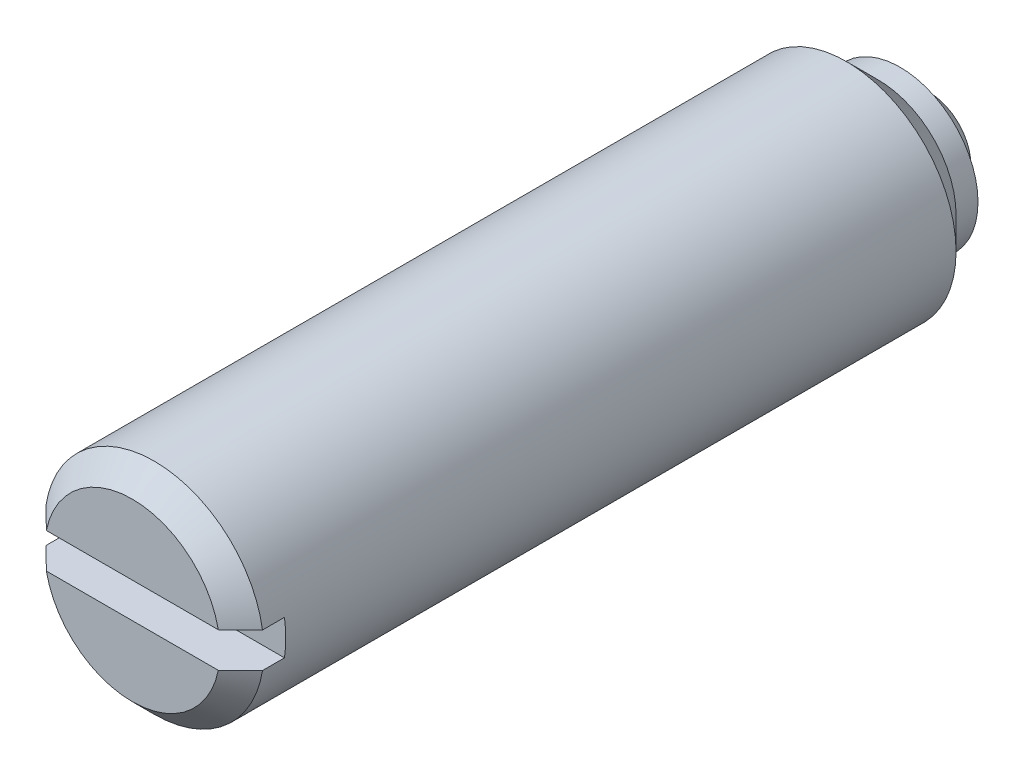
ISO-10303-21;
HEADER;
FILE_DESCRIPTION(('STEP AP214'),'2;1');
FILE_NAME('part.step','',(''),(''),'','','');
FILE_SCHEMA(('AUTOMOTIVE_DESIGN { 1 0 10303 214 1 1 1 1 }'));
ENDSEC;
DATA;
#1=APPLICATION_CONTEXT('core data for automotive mechanical design processes');
#2=APPLICATION_PROTOCOL_DEFINITION('international standard','automotive_design',2000,#1);
#3=PRODUCT_CONTEXT('',#1,'mechanical');
#4=PRODUCT('Part','Part','',(#3));
#5=PRODUCT_RELATED_PRODUCT_CATEGORY('part','',(#4));
#6=PRODUCT_DEFINITION_FORMATION('','',#4);
#7=PRODUCT_DEFINITION_CONTEXT('part definition',#1,'design');
#8=PRODUCT_DEFINITION('design','',#6,#7);
#9=PRODUCT_DEFINITION_SHAPE('','',#8);
#10=(LENGTH_UNIT() NAMED_UNIT(*) SI_UNIT(.MILLI.,.METRE.));
#11=(NAMED_UNIT(*) PLANE_ANGLE_UNIT() SI_UNIT($,.RADIAN.));
#12=(NAMED_UNIT(*) SI_UNIT($,.STERADIAN.) SOLID_ANGLE_UNIT());
#13=UNCERTAINTY_MEASURE_WITH_UNIT(LENGTH_MEASURE(1.E-05),#10,'distance_accuracy_value','');
#14=(GEOMETRIC_REPRESENTATION_CONTEXT(3) GLOBAL_UNCERTAINTY_ASSIGNED_CONTEXT((#13)) GLOBAL_UNIT_ASSIGNED_CONTEXT((#10,
#11,#12)) REPRESENTATION_CONTEXT('',''));
#15=CARTESIAN_POINT('',(0.,0.,0.));
#16=DIRECTION('',(0.,0.,1.));
#17=DIRECTION('',(1.,0.,0.));
#18=AXIS2_PLACEMENT_3D('',#15,#16,#17);
#19=CARTESIAN_POINT('',(0.,0.,2.));
#20=DIRECTION('',(0.,0.,-1.));
#21=DIRECTION('',(-1.,0.,0.));
#22=AXIS2_PLACEMENT_3D('',#19,#20,#21);
#23=PLANE('',#22);
#24=CARTESIAN_POINT('',(0.,0.,2.));
#25=DIRECTION('',(0.,0.,-1.));
#26=DIRECTION('',(-1.,0.,0.));
#27=AXIS2_PLACEMENT_3D('',#24,#25,#26);
#28=CIRCLE('',#27,2.82842712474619);
#29=CARTESIAN_POINT('',(-2.82842712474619,0.,2.));
#30=VERTEX_POINT('',#29);
#31=EDGE_CURVE('E151',#30,#30,#28,.T.);
#32=ORIENTED_EDGE('',*,*,#31,.F.);
#33=EDGE_LOOP('',(#32));
#34=FACE_BOUND('',#33,.T.);
#35=CARTESIAN_POINT('',(0.,0.,2.));
#36=DIRECTION('',(0.,0.,1.));
#37=DIRECTION('',(1.,0.,0.));
#38=AXIS2_PLACEMENT_3D('',#35,#36,#37);
#39=CIRCLE('',#38,3.55);
#40=CARTESIAN_POINT('',(3.55,0.,2.));
#41=VERTEX_POINT('',#40);
#42=EDGE_CURVE('E158',#41,#41,#39,.T.);
#43=ORIENTED_EDGE('',*,*,#42,.F.);
#44=EDGE_LOOP('',(#43));
#45=FACE_BOUND('',#44,.T.);
#46=ADVANCED_FACE('F14',(#34,#45),#23,.T.);
#47=CARTESIAN_POINT('',(0.,0.,3.));
#48=DIRECTION('',(0.,0.,-1.));
#49=DIRECTION('',(1.,0.,0.));
#50=AXIS2_PLACEMENT_3D('',#47,#48,#49);
#51=SPHERICAL_SURFACE('',#50,3.);
#52=ORIENTED_EDGE('',*,*,#31,.T.);
#53=EDGE_LOOP('',(#52));
#54=FACE_BOUND('',#53,.T.);
#55=ADVANCED_FACE('F178',(#54),#51,.T.);
#56=CARTESIAN_POINT('',(0.,0.,40.6314909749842));
#57=DIRECTION('',(0.,0.,1.));
#58=DIRECTION('',(1.,0.,0.));
#59=AXIS2_PLACEMENT_3D('',#56,#57,#58);
#60=CYLINDRICAL_SURFACE('',#59,3.55);
#61=ORIENTED_EDGE('',*,*,#42,.T.);
#62=EDGE_LOOP('',(#61));
#63=FACE_BOUND('',#62,.T.);
#64=CARTESIAN_POINT('',(0.,0.,3.));
#65=DIRECTION('',(0.,0.,1.));
#66=DIRECTION('',(1.,0.,0.));
#67=AXIS2_PLACEMENT_3D('',#64,#65,#66);
#68=CIRCLE('',#67,3.55);
#69=CARTESIAN_POINT('',(3.55,0.,3.));
#70=VERTEX_POINT('',#69);
#71=EDGE_CURVE('E161',#70,#70,#68,.T.);
#72=ORIENTED_EDGE('',*,*,#71,.F.);
#73=EDGE_LOOP('',(#72));
#74=FACE_BOUND('',#73,.T.);
#75=ADVANCED_FACE('F170',(#63,#74),#60,.T.);
#76=CARTESIAN_POINT('',(0.,0.,4.45));
#77=DIRECTION('',(0.,0.,1.));
#78=DIRECTION('',(1.,0.,0.));
#79=AXIS2_PLACEMENT_3D('',#76,#77,#78);
#80=CONICAL_SURFACE('',#79,5.,0.785398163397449);
#81=ORIENTED_EDGE('',*,*,#71,.T.);
#82=EDGE_LOOP('',(#81));
#83=FACE_BOUND('',#82,.T.);
#84=CARTESIAN_POINT('',(0.,0.,4.45));
#85=DIRECTION('',(0.,0.,1.));
#86=DIRECTION('',(1.,0.,0.));
#87=AXIS2_PLACEMENT_3D('',#84,#85,#86);
#88=CIRCLE('',#87,5.);
#89=CARTESIAN_POINT('',(5.,0.,4.45));
#90=VERTEX_POINT('',#89);
#91=EDGE_CURVE('E164',#90,#90,#88,.T.);
#92=ORIENTED_EDGE('',*,*,#91,.F.);
#93=EDGE_LOOP('',(#92));
#94=FACE_BOUND('',#93,.T.);
#95=ADVANCED_FACE('F168',(#83,#94),#80,.T.);
#96=CARTESIAN_POINT('',(0.,5.,37.));
#97=DIRECTION('',(0.,0.,1.));
#98=DIRECTION('',(1.,0.,0.));
#99=AXIS2_PLACEMENT_3D('',#96,#97,#98);
#100=PLANE('',#99);
#101=DIRECTION('',(1.,0.,0.));
#102=VECTOR('',#101,1.);
#103=CARTESIAN_POINT('',(-4.93558507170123,-0.8,37.));
#104=LINE('',#103,#102);
#105=CARTESIAN_POINT('',(-3.91918358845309,-0.8,37.));
#106=VERTEX_POINT('',#105);
#107=CARTESIAN_POINT('',(3.91918358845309,-0.8,37.));
#108=VERTEX_POINT('',#107);
#109=EDGE_CURVE('E148',#106,#108,#104,.T.);
#110=ORIENTED_EDGE('',*,*,#109,.F.);
#111=CARTESIAN_POINT('',(0.,0.,37.));
#112=DIRECTION('',(0.,0.,1.));
#113=DIRECTION('',(1.,0.,0.));
#114=AXIS2_PLACEMENT_3D('',#111,#112,#113);
#115=CIRCLE('',#114,4.);
#116=EDGE_CURVE('E142',#106,#108,#115,.T.);
#117=ORIENTED_EDGE('',*,*,#116,.T.);
#118=EDGE_LOOP('',(#110,#117));
#119=FACE_BOUND('',#118,.T.);
#120=ADVANCED_FACE('F124',(#119),#100,.T.);
#121=CARTESIAN_POINT('',(-4.93558507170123,-0.8,35.));
#122=DIRECTION('',(0.,-1.,0.));
#123=DIRECTION('',(1.,0.,0.));
#124=AXIS2_PLACEMENT_3D('',#121,#122,#123);
#125=PLANE('',#124);
#126=DIRECTION('',(0.,0.,1.));
#127=VECTOR('',#126,1.);
#128=CARTESIAN_POINT('',(-4.93558507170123,-0.8,35.));
#129=LINE('',#128,#127);
#130=CARTESIAN_POINT('',(-4.93558507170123,-0.8,35.));
#131=VERTEX_POINT('',#130);
#132=CARTESIAN_POINT('',(-4.93558507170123,-0.8,36.));
#133=VERTEX_POINT('',#132);
#134=EDGE_CURVE('E81',#131,#133,#129,.T.);
#135=ORIENTED_EDGE('',*,*,#134,.T.);
#136=CARTESIAN_POINT('',(-4.93558507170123,-0.8,36.));
#137=CARTESIAN_POINT('',(-4.85102221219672,-0.8,36.0834727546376));
#138=CARTESIAN_POINT('',(-4.76643256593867,-0.8,36.1669183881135));
#139=CARTESIAN_POINT('',(-4.59718901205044,-0.8,36.3337443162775));
#140=CARTESIAN_POINT('',(-4.51253510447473,-0.8,36.4171246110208));
#141=CARTESIAN_POINT('',(-4.34315217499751,-0.8,36.583808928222));
#142=CARTESIAN_POINT('',(-4.25842315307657,-0.8,36.6671129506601));
#143=CARTESIAN_POINT('',(-4.08887483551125,-0.8,36.8336292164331));
#144=CARTESIAN_POINT('',(-4.00405553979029,-0.8,36.9168414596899));
#145=CARTESIAN_POINT('',(-3.91918358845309,-0.8,37.));
#146=B_SPLINE_CURVE_WITH_KNOTS('',3,(#136,#137,#138,#139,#140,#141,#142,#143,#144,#145),
.UNSPECIFIED.,.F.,.F.,(4,2,2,2,4),(0.,0.356464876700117,0.712929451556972,1.06939411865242,
1.42585908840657),.UNSPECIFIED.);
#147=EDGE_CURVE('E110',#133,#106,#146,.T.);
#148=ORIENTED_EDGE('',*,*,#147,.T.);
#149=ORIENTED_EDGE('',*,*,#109,.T.);
#150=CARTESIAN_POINT('',(3.91918358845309,-0.8,37.));
#151=CARTESIAN_POINT('',(4.00405553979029,-0.8,36.9168414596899));
#152=CARTESIAN_POINT('',(4.08887483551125,-0.800000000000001,36.8336292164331));
#153=CARTESIAN_POINT('',(4.25842315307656,-0.800000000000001,36.6671129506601));
#154=CARTESIAN_POINT('',(4.34315217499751,-0.800000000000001,36.583808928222));
#155=CARTESIAN_POINT('',(4.51253510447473,-0.800000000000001,36.4171246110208));
#156=CARTESIAN_POINT('',(4.59718901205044,-0.800000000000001,36.3337443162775));
#157=CARTESIAN_POINT('',(4.76643256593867,-0.800000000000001,36.1669183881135));
#158=CARTESIAN_POINT('',(4.85102221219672,-0.8,36.0834727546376));
#159=CARTESIAN_POINT('',(4.93558507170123,-0.8,36.));
#160=B_SPLINE_CURVE_WITH_KNOTS('',3,(#150,#151,#152,#153,#154,#155,#156,#157,#158,#159),
.UNSPECIFIED.,.F.,.F.,(4,2,2,2,4),(0.,0.356464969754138,0.712929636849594,1.06939421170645,
1.42585908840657),.UNSPECIFIED.);
#161=CARTESIAN_POINT('',(4.93558507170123,-0.8,36.));
#162=VERTEX_POINT('',#161);
#163=EDGE_CURVE('E103',#108,#162,#160,.T.);
#164=ORIENTED_EDGE('',*,*,#163,.T.);
#165=DIRECTION('',(0.,0.,1.));
#166=VECTOR('',#165,1.);
#167=CARTESIAN_POINT('',(4.93558507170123,-0.8,35.));
#168=LINE('',#167,#166);
#169=CARTESIAN_POINT('',(4.93558507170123,-0.8,35.));
#170=VERTEX_POINT('',#169);
#171=EDGE_CURVE('E83',#170,#162,#168,.T.);
#172=ORIENTED_EDGE('',*,*,#171,.F.);
#173=DIRECTION('',(1.,0.,0.));
#174=VECTOR('',#173,1.);
#175=CARTESIAN_POINT('',(-4.93558507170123,-0.8,35.));
#176=LINE('',#175,#174);
#177=EDGE_CURVE('E68',#131,#170,#176,.T.);
#178=ORIENTED_EDGE('',*,*,#177,.F.);
#179=EDGE_LOOP('',(#135,#148,#149,#164,#172,#178));
#180=FACE_BOUND('',#179,.T.);
#181=ADVANCED_FACE('F80',(#180),#125,.F.);
#182=DIRECTION('',(1.,0.,0.));
#183=VECTOR('',#182,1.);
#184=CARTESIAN_POINT('',(-4.93558507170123,0.8,37.));
#185=LINE('',#184,#183);
#186=CARTESIAN_POINT('',(-3.91918358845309,0.8,37.));
#187=VERTEX_POINT('',#186);
#188=CARTESIAN_POINT('',(3.91918358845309,0.8,37.));
#189=VERTEX_POINT('',#188);
#190=EDGE_CURVE('E75',#187,#189,#185,.T.);
#191=ORIENTED_EDGE('',*,*,#190,.T.);
#192=CARTESIAN_POINT('',(0.,0.,37.));
#193=DIRECTION('',(0.,0.,1.));
#194=DIRECTION('',(1.,0.,0.));
#195=AXIS2_PLACEMENT_3D('',#192,#193,#194);
#196=CIRCLE('',#195,4.);
#197=EDGE_CURVE('E9',#189,#187,#196,.T.);
#198=ORIENTED_EDGE('',*,*,#197,.T.);
#199=EDGE_LOOP('',(#191,#198));
#200=FACE_BOUND('',#199,.T.);
#201=ADVANCED_FACE('F123',(#200),#100,.T.);
#202=CARTESIAN_POINT('',(-4.93558507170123,0.8,35.));
#203=DIRECTION('',(0.,-1.,0.));
#204=DIRECTION('',(1.,0.,0.));
#205=AXIS2_PLACEMENT_3D('',#202,#203,#204);
#206=PLANE('',#205);
#207=DIRECTION('',(0.,0.,1.));
#208=VECTOR('',#207,1.);
#209=CARTESIAN_POINT('',(4.93558507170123,0.8,35.));
#210=LINE('',#209,#208);
#211=CARTESIAN_POINT('',(4.93558507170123,0.8,35.));
#212=VERTEX_POINT('',#211);
#213=CARTESIAN_POINT('',(4.93558507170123,0.8,36.));
#214=VERTEX_POINT('',#213);
#215=EDGE_CURVE('E92',#212,#214,#210,.T.);
#216=ORIENTED_EDGE('',*,*,#215,.T.);
#217=CARTESIAN_POINT('',(4.93558507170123,0.8,36.));
#218=CARTESIAN_POINT('',(4.85102221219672,0.8,36.0834727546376));
#219=CARTESIAN_POINT('',(4.76643256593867,0.799999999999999,36.1669183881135));
#220=CARTESIAN_POINT('',(4.59718901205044,0.799999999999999,36.3337443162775));
#221=CARTESIAN_POINT('',(4.51253510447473,0.799999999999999,36.4171246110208));
#222=CARTESIAN_POINT('',(4.34315217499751,0.799999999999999,36.583808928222));
#223=CARTESIAN_POINT('',(4.25842315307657,0.799999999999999,36.6671129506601));
#224=CARTESIAN_POINT('',(4.08887483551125,0.799999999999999,36.8336292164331));
#225=CARTESIAN_POINT('',(4.00405553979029,0.8,36.9168414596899));
#226=CARTESIAN_POINT('',(3.91918358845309,0.8,37.));
#227=B_SPLINE_CURVE_WITH_KNOTS('',3,(#217,#218,#219,#220,#221,#222,#223,#224,#225,#226),
.UNSPECIFIED.,.F.,.F.,(4,2,2,2,4),(0.,0.356464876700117,0.712929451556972,1.06939411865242,
1.42585908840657),.UNSPECIFIED.);
#228=EDGE_CURVE('E23',#214,#189,#227,.T.);
#229=ORIENTED_EDGE('',*,*,#228,.T.);
#230=ORIENTED_EDGE('',*,*,#190,.F.);
#231=CARTESIAN_POINT('',(-3.91918358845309,0.8,37.));
#232=CARTESIAN_POINT('',(-4.00405553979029,0.8,36.9168414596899));
#233=CARTESIAN_POINT('',(-4.08887483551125,0.8,36.8336292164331));
#234=CARTESIAN_POINT('',(-4.25842315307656,0.8,36.6671129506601));
#235=CARTESIAN_POINT('',(-4.34315217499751,0.8,36.583808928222));
#236=CARTESIAN_POINT('',(-4.51253510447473,0.8,36.4171246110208));
#237=CARTESIAN_POINT('',(-4.59718901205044,0.8,36.3337443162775));
#238=CARTESIAN_POINT('',(-4.76643256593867,0.8,36.1669183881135));
#239=CARTESIAN_POINT('',(-4.85102221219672,0.8,36.0834727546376));
#240=CARTESIAN_POINT('',(-4.93558507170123,0.8,36.));
#241=B_SPLINE_CURVE_WITH_KNOTS('',3,(#231,#232,#233,#234,#235,#236,#237,#238,#239,#240),
.UNSPECIFIED.,.F.,.F.,(4,2,2,2,4),(0.,0.356464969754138,0.712929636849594,1.06939421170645,
1.42585908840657),.UNSPECIFIED.);
#242=CARTESIAN_POINT('',(-4.93558507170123,0.8,36.));
#243=VERTEX_POINT('',#242);
#244=EDGE_CURVE('E133',#187,#243,#241,.T.);
#245=ORIENTED_EDGE('',*,*,#244,.T.);
#246=DIRECTION('',(0.,0.,1.));
#247=VECTOR('',#246,1.);
#248=CARTESIAN_POINT('',(-4.93558507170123,0.8,35.));
#249=LINE('',#248,#247);
#250=CARTESIAN_POINT('',(-4.93558507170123,0.8,35.));
#251=VERTEX_POINT('',#250);
#252=EDGE_CURVE('E97',#251,#243,#249,.T.);
#253=ORIENTED_EDGE('',*,*,#252,.F.);
#254=DIRECTION('',(1.,0.,0.));
#255=VECTOR('',#254,1.);
#256=CARTESIAN_POINT('',(-4.93558507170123,0.8,35.));
#257=LINE('',#256,#255);
#258=EDGE_CURVE('E71',#251,#212,#257,.T.);
#259=ORIENTED_EDGE('',*,*,#258,.T.);
#260=EDGE_LOOP('',(#216,#229,#230,#245,#253,#259));
#261=FACE_BOUND('',#260,.T.);
#262=ADVANCED_FACE('F126',(#261),#206,.T.);
#263=CARTESIAN_POINT('',(0.,0.,35.));
#264=DIRECTION('',(0.,0.,1.));
#265=DIRECTION('',(1.,0.,0.));
#266=AXIS2_PLACEMENT_3D('',#263,#264,#265);
#267=PLANE('',#266);
#268=CARTESIAN_POINT('',(0.,0.,35.));
#269=DIRECTION('',(0.,0.,1.));
#270=DIRECTION('',(1.,0.,0.));
#271=AXIS2_PLACEMENT_3D('',#268,#269,#270);
#272=CIRCLE('',#271,5.);
#273=EDGE_CURVE('E65',#251,#131,#272,.T.);
#274=ORIENTED_EDGE('',*,*,#273,.T.);
#275=ORIENTED_EDGE('',*,*,#177,.T.);
#276=EDGE_CURVE('E77',#170,#212,#272,.T.);
#277=ORIENTED_EDGE('',*,*,#276,.T.);
#278=ORIENTED_EDGE('',*,*,#258,.F.);
#279=EDGE_LOOP('',(#274,#275,#277,#278));
#280=FACE_BOUND('',#279,.T.);
#281=ADVANCED_FACE('F67',(#280),#267,.T.);
#282=CARTESIAN_POINT('',(0.,0.,17.));
#283=DIRECTION('',(0.,0.,-1.));
#284=DIRECTION('',(-1.,0.,0.));
#285=AXIS2_PLACEMENT_3D('',#282,#283,#284);
#286=CYLINDRICAL_SURFACE('',#285,5.);
#287=ORIENTED_EDGE('',*,*,#171,.T.);
#288=CARTESIAN_POINT('',(0.,0.,36.));
#289=DIRECTION('',(0.,0.,1.));
#290=DIRECTION('',(1.,0.,0.));
#291=AXIS2_PLACEMENT_3D('',#288,#289,#290);
#292=CIRCLE('',#291,5.);
#293=EDGE_CURVE('E90',#162,#133,#292,.F.);
#294=ORIENTED_EDGE('',*,*,#293,.T.);
#295=ORIENTED_EDGE('',*,*,#134,.F.);
#296=ORIENTED_EDGE('',*,*,#273,.F.);
#297=ORIENTED_EDGE('',*,*,#252,.T.);
#298=CARTESIAN_POINT('',(0.,0.,36.));
#299=DIRECTION('',(0.,0.,1.));
#300=DIRECTION('',(1.,0.,0.));
#301=AXIS2_PLACEMENT_3D('',#298,#299,#300);
#302=CIRCLE('',#301,5.);
#303=EDGE_CURVE('E99',#243,#214,#302,.F.);
#304=ORIENTED_EDGE('',*,*,#303,.T.);
#305=ORIENTED_EDGE('',*,*,#215,.F.);
#306=ORIENTED_EDGE('',*,*,#276,.F.);
#307=EDGE_LOOP('',(#287,#294,#295,#296,#297,#304,#305,#306));
#308=FACE_BOUND('',#307,.T.);
#309=ORIENTED_EDGE('',*,*,#91,.T.);
#310=EDGE_LOOP('',(#309));
#311=FACE_BOUND('',#310,.T.);
#312=ADVANCED_FACE('F87',(#308,#311),#286,.T.);
#313=CARTESIAN_POINT('',(0.,0.,36.));
#314=DIRECTION('',(0.,0.,-1.));
#315=DIRECTION('',(-1.,0.,0.));
#316=AXIS2_PLACEMENT_3D('',#313,#314,#315);
#317=CONICAL_SURFACE('',#316,5.,0.78539816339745);
#318=ORIENTED_EDGE('',*,*,#163,.F.);
#319=ORIENTED_EDGE('',*,*,#116,.F.);
#320=ORIENTED_EDGE('',*,*,#147,.F.);
#321=ORIENTED_EDGE('',*,*,#293,.F.);
#322=EDGE_LOOP('',(#318,#319,#320,#321));
#323=FACE_BOUND('',#322,.T.);
#324=ADVANCED_FACE('F116',(#323),#317,.T.);
#325=CARTESIAN_POINT('',(0.,0.,36.));
#326=DIRECTION('',(0.,0.,-1.));
#327=DIRECTION('',(-1.,0.,0.));
#328=AXIS2_PLACEMENT_3D('',#325,#326,#327);
#329=CONICAL_SURFACE('',#328,5.,0.78539816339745);
#330=ORIENTED_EDGE('',*,*,#244,.F.);
#331=ORIENTED_EDGE('',*,*,#197,.F.);
#332=ORIENTED_EDGE('',*,*,#228,.F.);
#333=ORIENTED_EDGE('',*,*,#303,.F.);
#334=EDGE_LOOP('',(#330,#331,#332,#333));
#335=FACE_BOUND('',#334,.T.);
#336=ADVANCED_FACE('F16',(#335),#329,.T.);
#337=CLOSED_SHELL('',(#46,#55,#75,#95,#120,#181,#201,#262,#281,#312,#324,#336));
#338=MANIFOLD_SOLID_BREP('B1',#337);
#339=ADVANCED_BREP_SHAPE_REPRESENTATION('',(#18,#338),#14);
#340=SHAPE_DEFINITION_REPRESENTATION(#9,#339);
ENDSEC;
END-ISO-10303-21;
